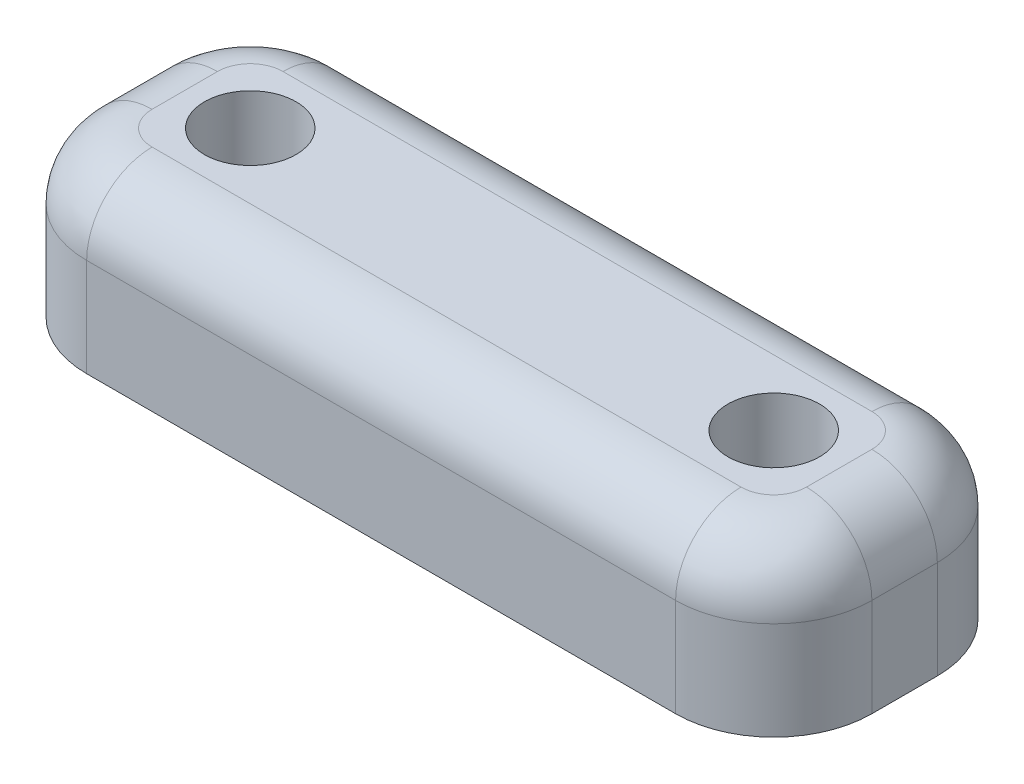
ISO-10303-21;
HEADER;
FILE_DESCRIPTION(('STEP AP214'),'2;1');
FILE_NAME('part.step','',(''),(''),'','','');
FILE_SCHEMA(('AUTOMOTIVE_DESIGN { 1 0 10303 214 1 1 1 1 }'));
ENDSEC;
DATA;
#1=APPLICATION_CONTEXT('core data for automotive mechanical design processes');
#2=APPLICATION_PROTOCOL_DEFINITION('international standard','automotive_design',2000,#1);
#3=PRODUCT_CONTEXT('',#1,'mechanical');
#4=PRODUCT('Part','Part','',(#3));
#5=PRODUCT_RELATED_PRODUCT_CATEGORY('part','',(#4));
#6=PRODUCT_DEFINITION_FORMATION('','',#4);
#7=PRODUCT_DEFINITION_CONTEXT('part definition',#1,'design');
#8=PRODUCT_DEFINITION('design','',#6,#7);
#9=PRODUCT_DEFINITION_SHAPE('','',#8);
#10=(LENGTH_UNIT() NAMED_UNIT(*) SI_UNIT(.MILLI.,.METRE.));
#11=(NAMED_UNIT(*) PLANE_ANGLE_UNIT() SI_UNIT($,.RADIAN.));
#12=(NAMED_UNIT(*) SI_UNIT($,.STERADIAN.) SOLID_ANGLE_UNIT());
#13=UNCERTAINTY_MEASURE_WITH_UNIT(LENGTH_MEASURE(1.E-05),#10,'distance_accuracy_value','');
#14=(GEOMETRIC_REPRESENTATION_CONTEXT(3) GLOBAL_UNCERTAINTY_ASSIGNED_CONTEXT((#13)) GLOBAL_UNIT_ASSIGNED_CONTEXT((#10,
#11,#12)) REPRESENTATION_CONTEXT('',''));
#15=CARTESIAN_POINT('',(0.,0.,0.));
#16=DIRECTION('',(0.,0.,1.));
#17=DIRECTION('',(1.,0.,0.));
#18=AXIS2_PLACEMENT_3D('',#15,#16,#17);
#19=CARTESIAN_POINT('',(0.,5.,0.));
#20=DIRECTION('',(0.,1.,0.));
#21=DIRECTION('',(0.,0.,1.));
#22=AXIS2_PLACEMENT_3D('',#19,#20,#21);
#23=PLANE('',#22);
#24=CARTESIAN_POINT('',(-9.,5.,0.752347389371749));
#25=DIRECTION('',(0.,1.,0.));
#26=DIRECTION('',(0.,0.,1.));
#27=AXIS2_PLACEMENT_3D('',#24,#25,#26);
#28=CIRCLE('',#27,1.);
#29=CARTESIAN_POINT('',(-9.,5.,-0.247652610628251));
#30=VERTEX_POINT('',#29);
#31=CARTESIAN_POINT('',(-10.,5.,0.75234738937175));
#32=VERTEX_POINT('',#31);
#33=EDGE_CURVE('E192',#30,#32,#28,.T.);
#34=ORIENTED_EDGE('',*,*,#33,.T.);
#35=DIRECTION('',(0.,0.,1.));
#36=VECTOR('',#35,1.);
#37=CARTESIAN_POINT('',(-10.,5.,2.75234738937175));
#38=LINE('',#37,#36);
#39=CARTESIAN_POINT('',(-10.,5.,2.75234738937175));
#40=VERTEX_POINT('',#39);
#41=EDGE_CURVE('E194',#32,#40,#38,.T.);
#42=ORIENTED_EDGE('',*,*,#41,.T.);
#43=CARTESIAN_POINT('',(-9.,5.,2.75234738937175));
#44=DIRECTION('',(0.,1.,0.));
#45=DIRECTION('',(0.,0.,1.));
#46=AXIS2_PLACEMENT_3D('',#43,#44,#45);
#47=CIRCLE('',#46,1.);
#48=CARTESIAN_POINT('',(-9.,5.,3.75234738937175));
#49=VERTEX_POINT('',#48);
#50=EDGE_CURVE('E181',#40,#49,#47,.T.);
#51=ORIENTED_EDGE('',*,*,#50,.T.);
#52=DIRECTION('',(1.,0.,0.));
#53=VECTOR('',#52,1.);
#54=CARTESIAN_POINT('',(9.,5.,3.75234738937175));
#55=LINE('',#54,#53);
#56=CARTESIAN_POINT('',(9.,5.,3.75234738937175));
#57=VERTEX_POINT('',#56);
#58=EDGE_CURVE('E179',#49,#57,#55,.T.);
#59=ORIENTED_EDGE('',*,*,#58,.T.);
#60=CARTESIAN_POINT('',(9.,5.,2.75234738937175));
#61=DIRECTION('',(0.,1.,0.));
#62=DIRECTION('',(0.,0.,1.));
#63=AXIS2_PLACEMENT_3D('',#60,#61,#62);
#64=CIRCLE('',#63,1.);
#65=CARTESIAN_POINT('',(10.,5.,2.75234738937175));
#66=VERTEX_POINT('',#65);
#67=EDGE_CURVE('E183',#57,#66,#64,.T.);
#68=ORIENTED_EDGE('',*,*,#67,.T.);
#69=DIRECTION('',(0.,0.,-1.));
#70=VECTOR('',#69,1.);
#71=CARTESIAN_POINT('',(10.,5.,0.752347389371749));
#72=LINE('',#71,#70);
#73=CARTESIAN_POINT('',(10.,5.,0.752347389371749));
#74=VERTEX_POINT('',#73);
#75=EDGE_CURVE('E185',#66,#74,#72,.T.);
#76=ORIENTED_EDGE('',*,*,#75,.T.);
#77=CARTESIAN_POINT('',(9.,5.,0.752347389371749));
#78=DIRECTION('',(0.,1.,0.));
#79=DIRECTION('',(0.,0.,1.));
#80=AXIS2_PLACEMENT_3D('',#77,#78,#79);
#81=CIRCLE('',#80,1.);
#82=CARTESIAN_POINT('',(9.,5.,-0.247652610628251));
#83=VERTEX_POINT('',#82);
#84=EDGE_CURVE('E187',#74,#83,#81,.T.);
#85=ORIENTED_EDGE('',*,*,#84,.T.);
#86=DIRECTION('',(-1.,0.,0.));
#87=VECTOR('',#86,1.);
#88=CARTESIAN_POINT('',(-9.,5.,-0.247652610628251));
#89=LINE('',#88,#87);
#90=EDGE_CURVE('E190',#83,#30,#89,.T.);
#91=ORIENTED_EDGE('',*,*,#90,.T.);
#92=EDGE_LOOP('',(#34,#42,#51,#59,#68,#76,#85,#91));
#93=FACE_BOUND('',#92,.T.);
#94=CARTESIAN_POINT('',(-8.,5.,1.75234738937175));
#95=DIRECTION('',(0.,1.,0.));
#96=DIRECTION('',(0.,0.,1.));
#97=AXIS2_PLACEMENT_3D('',#94,#95,#96);
#98=CIRCLE('',#97,1.4);
#99=CARTESIAN_POINT('',(-8.,5.,3.15234738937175));
#100=VERTEX_POINT('',#99);
#101=EDGE_CURVE('E242',#100,#100,#98,.T.);
#102=ORIENTED_EDGE('',*,*,#101,.F.);
#103=EDGE_LOOP('',(#102));
#104=FACE_BOUND('',#103,.T.);
#105=CARTESIAN_POINT('',(8.,5.,1.75234738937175));
#106=DIRECTION('',(0.,1.,0.));
#107=DIRECTION('',(0.,0.,1.));
#108=AXIS2_PLACEMENT_3D('',#105,#106,#107);
#109=CIRCLE('',#108,1.4);
#110=CARTESIAN_POINT('',(8.,5.,3.15234738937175));
#111=VERTEX_POINT('',#110);
#112=EDGE_CURVE('E234',#111,#111,#109,.T.);
#113=ORIENTED_EDGE('',*,*,#112,.F.);
#114=EDGE_LOOP('',(#113));
#115=FACE_BOUND('',#114,.T.);
#116=ADVANCED_FACE('F34',(#93,#104,#115),#23,.T.);
#117=CARTESIAN_POINT('',(0.,0.,0.));
#118=DIRECTION('',(0.,1.,0.));
#119=DIRECTION('',(0.,0.,1.));
#120=AXIS2_PLACEMENT_3D('',#117,#118,#119);
#121=PLANE('',#120);
#122=DIRECTION('',(0.,0.,-1.));
#123=VECTOR('',#122,1.);
#124=CARTESIAN_POINT('',(12.,0.,-2.24765261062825));
#125=LINE('',#124,#123);
#126=CARTESIAN_POINT('',(12.,0.,2.75234738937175));
#127=VERTEX_POINT('',#126);
#128=CARTESIAN_POINT('',(12.,0.,0.752347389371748));
#129=VERTEX_POINT('',#128);
#130=EDGE_CURVE('E131',#127,#129,#125,.T.);
#131=ORIENTED_EDGE('',*,*,#130,.F.);
#132=CARTESIAN_POINT('',(9.,0.,2.75234738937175));
#133=DIRECTION('',(0.,1.,0.));
#134=DIRECTION('',(0.,0.,1.));
#135=AXIS2_PLACEMENT_3D('',#132,#133,#134);
#136=CIRCLE('',#135,3.);
#137=CARTESIAN_POINT('',(9.,0.,5.75234738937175));
#138=VERTEX_POINT('',#137);
#139=EDGE_CURVE('E141',#127,#138,#136,.F.);
#140=ORIENTED_EDGE('',*,*,#139,.T.);
#141=DIRECTION('',(1.,0.,0.));
#142=VECTOR('',#141,1.);
#143=CARTESIAN_POINT('',(-12.,0.,5.75234738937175));
#144=LINE('',#143,#142);
#145=CARTESIAN_POINT('',(-9.,0.,5.75234738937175));
#146=VERTEX_POINT('',#145);
#147=EDGE_CURVE('E156',#146,#138,#144,.T.);
#148=ORIENTED_EDGE('',*,*,#147,.F.);
#149=CARTESIAN_POINT('',(-9.,0.,2.75234738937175));
#150=DIRECTION('',(0.,1.,0.));
#151=DIRECTION('',(0.,0.,1.));
#152=AXIS2_PLACEMENT_3D('',#149,#150,#151);
#153=CIRCLE('',#152,3.);
#154=CARTESIAN_POINT('',(-12.,0.,2.75234738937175));
#155=VERTEX_POINT('',#154);
#156=EDGE_CURVE('E166',#146,#155,#153,.F.);
#157=ORIENTED_EDGE('',*,*,#156,.T.);
#158=DIRECTION('',(0.,0.,1.));
#159=VECTOR('',#158,1.);
#160=CARTESIAN_POINT('',(-12.,0.,-2.24765261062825));
#161=LINE('',#160,#159);
#162=CARTESIAN_POINT('',(-12.,0.,0.75234738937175));
#163=VERTEX_POINT('',#162);
#164=EDGE_CURVE('E160',#163,#155,#161,.T.);
#165=ORIENTED_EDGE('',*,*,#164,.F.);
#166=CARTESIAN_POINT('',(-9.,0.,0.752347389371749));
#167=DIRECTION('',(0.,1.,0.));
#168=DIRECTION('',(0.,0.,1.));
#169=AXIS2_PLACEMENT_3D('',#166,#167,#168);
#170=CIRCLE('',#169,3.);
#171=CARTESIAN_POINT('',(-9.,0.,-2.24765261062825));
#172=VERTEX_POINT('',#171);
#173=EDGE_CURVE('E137',#163,#172,#170,.F.);
#174=ORIENTED_EDGE('',*,*,#173,.T.);
#175=DIRECTION('',(-1.,0.,0.));
#176=VECTOR('',#175,1.);
#177=CARTESIAN_POINT('',(-12.,0.,-2.24765261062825));
#178=LINE('',#177,#176);
#179=CARTESIAN_POINT('',(9.,0.,-2.24765261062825));
#180=VERTEX_POINT('',#179);
#181=EDGE_CURVE('E155',#180,#172,#178,.T.);
#182=ORIENTED_EDGE('',*,*,#181,.F.);
#183=CARTESIAN_POINT('',(9.,0.,0.752347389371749));
#184=DIRECTION('',(0.,1.,0.));
#185=DIRECTION('',(0.,0.,1.));
#186=AXIS2_PLACEMENT_3D('',#183,#184,#185);
#187=CIRCLE('',#186,3.);
#188=EDGE_CURVE('E149',#180,#129,#187,.F.);
#189=ORIENTED_EDGE('',*,*,#188,.T.);
#190=EDGE_LOOP('',(#131,#140,#148,#157,#165,#174,#182,#189));
#191=FACE_BOUND('',#190,.T.);
#192=CARTESIAN_POINT('',(-8.,0.,1.75234738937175));
#193=DIRECTION('',(0.,1.,0.));
#194=DIRECTION('',(0.,0.,1.));
#195=AXIS2_PLACEMENT_3D('',#192,#193,#194);
#196=CIRCLE('',#195,1.4);
#197=CARTESIAN_POINT('',(-8.,0.,3.15234738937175));
#198=VERTEX_POINT('',#197);
#199=EDGE_CURVE('E239',#198,#198,#196,.T.);
#200=ORIENTED_EDGE('',*,*,#199,.T.);
#201=EDGE_LOOP('',(#200));
#202=FACE_BOUND('',#201,.T.);
#203=CARTESIAN_POINT('',(8.,0.,1.75234738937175));
#204=DIRECTION('',(0.,1.,0.));
#205=DIRECTION('',(0.,0.,1.));
#206=AXIS2_PLACEMENT_3D('',#203,#204,#205);
#207=CIRCLE('',#206,1.4);
#208=CARTESIAN_POINT('',(8.,0.,3.15234738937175));
#209=VERTEX_POINT('',#208);
#210=EDGE_CURVE('E228',#209,#209,#207,.T.);
#211=ORIENTED_EDGE('',*,*,#210,.T.);
#212=EDGE_LOOP('',(#211));
#213=FACE_BOUND('',#212,.T.);
#214=ADVANCED_FACE('F151',(#191,#202,#213),#121,.F.);
#215=CARTESIAN_POINT('',(-12.,5.,-2.24765261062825));
#216=DIRECTION('',(1.,0.,0.));
#217=DIRECTION('',(0.,0.,-1.));
#218=AXIS2_PLACEMENT_3D('',#215,#216,#217);
#219=PLANE('',#218);
#220=DIRECTION('',(0.,-1.,0.));
#221=VECTOR('',#220,1.);
#222=CARTESIAN_POINT('',(-12.,5.,2.75234738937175));
#223=LINE('',#222,#221);
#224=CARTESIAN_POINT('',(-12.,3.,2.75234738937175));
#225=VERTEX_POINT('',#224);
#226=EDGE_CURVE('E177',#155,#225,#223,.F.);
#227=ORIENTED_EDGE('',*,*,#226,.T.);
#228=DIRECTION('',(0.,0.,1.));
#229=VECTOR('',#228,1.);
#230=CARTESIAN_POINT('',(-12.,3.,0.75234738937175));
#231=LINE('',#230,#229);
#232=CARTESIAN_POINT('',(-12.,3.,0.75234738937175));
#233=VERTEX_POINT('',#232);
#234=EDGE_CURVE('E59',#225,#233,#231,.F.);
#235=ORIENTED_EDGE('',*,*,#234,.T.);
#236=DIRECTION('',(0.,-1.,0.));
#237=VECTOR('',#236,1.);
#238=CARTESIAN_POINT('',(-12.,5.,0.75234738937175));
#239=LINE('',#238,#237);
#240=EDGE_CURVE('E175',#233,#163,#239,.T.);
#241=ORIENTED_EDGE('',*,*,#240,.T.);
#242=ORIENTED_EDGE('',*,*,#164,.T.);
#243=EDGE_LOOP('',(#227,#235,#241,#242));
#244=FACE_BOUND('',#243,.T.);
#245=ADVANCED_FACE('F249',(#244),#219,.F.);
#246=CARTESIAN_POINT('',(-12.,5.,5.75234738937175));
#247=DIRECTION('',(0.,0.,-1.));
#248=DIRECTION('',(-1.,0.,0.));
#249=AXIS2_PLACEMENT_3D('',#246,#247,#248);
#250=PLANE('',#249);
#251=DIRECTION('',(0.,-1.,0.));
#252=VECTOR('',#251,1.);
#253=CARTESIAN_POINT('',(9.,5.,5.75234738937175));
#254=LINE('',#253,#252);
#255=CARTESIAN_POINT('',(9.,3.,5.75234738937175));
#256=VERTEX_POINT('',#255);
#257=EDGE_CURVE('E144',#138,#256,#254,.F.);
#258=ORIENTED_EDGE('',*,*,#257,.T.);
#259=DIRECTION('',(1.,0.,0.));
#260=VECTOR('',#259,1.);
#261=CARTESIAN_POINT('',(-9.,3.,5.75234738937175));
#262=LINE('',#261,#260);
#263=CARTESIAN_POINT('',(-9.,3.,5.75234738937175));
#264=VERTEX_POINT('',#263);
#265=EDGE_CURVE('E11',#256,#264,#262,.F.);
#266=ORIENTED_EDGE('',*,*,#265,.T.);
#267=DIRECTION('',(0.,-1.,0.));
#268=VECTOR('',#267,1.);
#269=CARTESIAN_POINT('',(-9.,5.,5.75234738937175));
#270=LINE('',#269,#268);
#271=EDGE_CURVE('E148',#264,#146,#270,.T.);
#272=ORIENTED_EDGE('',*,*,#271,.T.);
#273=ORIENTED_EDGE('',*,*,#147,.T.);
#274=EDGE_LOOP('',(#258,#266,#272,#273));
#275=FACE_BOUND('',#274,.T.);
#276=ADVANCED_FACE('F288',(#275),#250,.F.);
#277=CARTESIAN_POINT('',(12.,5.,-2.24765261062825));
#278=DIRECTION('',(-1.,0.,0.));
#279=DIRECTION('',(0.,0.,1.));
#280=AXIS2_PLACEMENT_3D('',#277,#278,#279);
#281=PLANE('',#280);
#282=DIRECTION('',(0.,-1.,0.));
#283=VECTOR('',#282,1.);
#284=CARTESIAN_POINT('',(12.,5.,0.752347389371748));
#285=LINE('',#284,#283);
#286=CARTESIAN_POINT('',(12.,3.,0.752347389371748));
#287=VERTEX_POINT('',#286);
#288=EDGE_CURVE('E138',#129,#287,#285,.F.);
#289=ORIENTED_EDGE('',*,*,#288,.T.);
#290=DIRECTION('',(0.,0.,-1.));
#291=VECTOR('',#290,1.);
#292=CARTESIAN_POINT('',(12.,3.,2.75234738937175));
#293=LINE('',#292,#291);
#294=CARTESIAN_POINT('',(12.,3.,2.75234738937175));
#295=VERTEX_POINT('',#294);
#296=EDGE_CURVE('E134',#287,#295,#293,.F.);
#297=ORIENTED_EDGE('',*,*,#296,.T.);
#298=DIRECTION('',(0.,-1.,0.));
#299=VECTOR('',#298,1.);
#300=CARTESIAN_POINT('',(12.,5.,2.75234738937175));
#301=LINE('',#300,#299);
#302=EDGE_CURVE('E126',#295,#127,#301,.T.);
#303=ORIENTED_EDGE('',*,*,#302,.T.);
#304=ORIENTED_EDGE('',*,*,#130,.T.);
#305=EDGE_LOOP('',(#289,#297,#303,#304));
#306=FACE_BOUND('',#305,.T.);
#307=ADVANCED_FACE('F129',(#306),#281,.F.);
#308=CARTESIAN_POINT('',(-12.,5.,-2.24765261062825));
#309=DIRECTION('',(0.,0.,1.));
#310=DIRECTION('',(1.,0.,0.));
#311=AXIS2_PLACEMENT_3D('',#308,#309,#310);
#312=PLANE('',#311);
#313=DIRECTION('',(0.,-1.,0.));
#314=VECTOR('',#313,1.);
#315=CARTESIAN_POINT('',(-9.,5.,-2.24765261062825));
#316=LINE('',#315,#314);
#317=CARTESIAN_POINT('',(-9.,3.,-2.24765261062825));
#318=VERTEX_POINT('',#317);
#319=EDGE_CURVE('E171',#172,#318,#316,.F.);
#320=ORIENTED_EDGE('',*,*,#319,.T.);
#321=DIRECTION('',(-1.,0.,0.));
#322=VECTOR('',#321,1.);
#323=CARTESIAN_POINT('',(9.,3.,-2.24765261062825));
#324=LINE('',#323,#322);
#325=CARTESIAN_POINT('',(9.,3.,-2.24765261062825));
#326=VERTEX_POINT('',#325);
#327=EDGE_CURVE('E43',#318,#326,#324,.F.);
#328=ORIENTED_EDGE('',*,*,#327,.T.);
#329=DIRECTION('',(0.,-1.,0.));
#330=VECTOR('',#329,1.);
#331=CARTESIAN_POINT('',(9.,5.,-2.24765261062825));
#332=LINE('',#331,#330);
#333=EDGE_CURVE('E173',#326,#180,#332,.T.);
#334=ORIENTED_EDGE('',*,*,#333,.T.);
#335=ORIENTED_EDGE('',*,*,#181,.T.);
#336=EDGE_LOOP('',(#320,#328,#334,#335));
#337=FACE_BOUND('',#336,.T.);
#338=ADVANCED_FACE('F271',(#337),#312,.F.);
#339=CARTESIAN_POINT('',(-8.,5.,1.75234738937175));
#340=DIRECTION('',(0.,-1.,0.));
#341=DIRECTION('',(0.,0.,-1.));
#342=AXIS2_PLACEMENT_3D('',#339,#340,#341);
#343=CYLINDRICAL_SURFACE('',#342,1.4);
#344=ORIENTED_EDGE('',*,*,#101,.T.);
#345=EDGE_LOOP('',(#344));
#346=FACE_BOUND('',#345,.T.);
#347=ORIENTED_EDGE('',*,*,#199,.F.);
#348=EDGE_LOOP('',(#347));
#349=FACE_BOUND('',#348,.T.);
#350=ADVANCED_FACE('F301',(#346,#349),#343,.F.);
#351=CARTESIAN_POINT('',(8.,5.,1.75234738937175));
#352=DIRECTION('',(0.,-1.,0.));
#353=DIRECTION('',(0.,0.,-1.));
#354=AXIS2_PLACEMENT_3D('',#351,#352,#353);
#355=CYLINDRICAL_SURFACE('',#354,1.4);
#356=ORIENTED_EDGE('',*,*,#112,.T.);
#357=EDGE_LOOP('',(#356));
#358=FACE_BOUND('',#357,.T.);
#359=ORIENTED_EDGE('',*,*,#210,.F.);
#360=EDGE_LOOP('',(#359));
#361=FACE_BOUND('',#360,.T.);
#362=ADVANCED_FACE('F298',(#358,#361),#355,.F.);
#363=CARTESIAN_POINT('',(9.,5.,2.75234738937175));
#364=DIRECTION('',(0.,-1.,0.));
#365=DIRECTION('',(0.,0.,-1.));
#366=AXIS2_PLACEMENT_3D('',#363,#364,#365);
#367=CYLINDRICAL_SURFACE('',#366,3.);
#368=ORIENTED_EDGE('',*,*,#302,.F.);
#369=CARTESIAN_POINT('',(9.,3.,2.75234738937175));
#370=DIRECTION('',(0.,1.,0.));
#371=DIRECTION('',(0.,0.,1.));
#372=AXIS2_PLACEMENT_3D('',#369,#370,#371);
#373=CIRCLE('',#372,3.);
#374=EDGE_CURVE('E200',#295,#256,#373,.F.);
#375=ORIENTED_EDGE('',*,*,#374,.T.);
#376=ORIENTED_EDGE('',*,*,#257,.F.);
#377=ORIENTED_EDGE('',*,*,#139,.F.);
#378=EDGE_LOOP('',(#368,#375,#376,#377));
#379=FACE_BOUND('',#378,.T.);
#380=ADVANCED_FACE('F142',(#379),#367,.T.);
#381=CARTESIAN_POINT('',(9.,5.,0.752347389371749));
#382=DIRECTION('',(0.,-1.,0.));
#383=DIRECTION('',(0.,0.,-1.));
#384=AXIS2_PLACEMENT_3D('',#381,#382,#383);
#385=CYLINDRICAL_SURFACE('',#384,3.);
#386=ORIENTED_EDGE('',*,*,#333,.F.);
#387=CARTESIAN_POINT('',(9.,3.,0.752347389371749));
#388=DIRECTION('',(0.,1.,0.));
#389=DIRECTION('',(0.,0.,1.));
#390=AXIS2_PLACEMENT_3D('',#387,#388,#389);
#391=CIRCLE('',#390,3.);
#392=EDGE_CURVE('E196',#326,#287,#391,.F.);
#393=ORIENTED_EDGE('',*,*,#392,.T.);
#394=ORIENTED_EDGE('',*,*,#288,.F.);
#395=ORIENTED_EDGE('',*,*,#188,.F.);
#396=EDGE_LOOP('',(#386,#393,#394,#395));
#397=FACE_BOUND('',#396,.T.);
#398=ADVANCED_FACE('F274',(#397),#385,.T.);
#399=CARTESIAN_POINT('',(-9.,5.,2.75234738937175));
#400=DIRECTION('',(0.,-1.,0.));
#401=DIRECTION('',(0.,0.,-1.));
#402=AXIS2_PLACEMENT_3D('',#399,#400,#401);
#403=CYLINDRICAL_SURFACE('',#402,3.);
#404=ORIENTED_EDGE('',*,*,#271,.F.);
#405=CARTESIAN_POINT('',(-9.,3.,2.75234738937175));
#406=DIRECTION('',(0.,1.,0.));
#407=DIRECTION('',(0.,0.,1.));
#408=AXIS2_PLACEMENT_3D('',#405,#406,#407);
#409=CIRCLE('',#408,3.);
#410=EDGE_CURVE('E202',#264,#225,#409,.F.);
#411=ORIENTED_EDGE('',*,*,#410,.T.);
#412=ORIENTED_EDGE('',*,*,#226,.F.);
#413=ORIENTED_EDGE('',*,*,#156,.F.);
#414=EDGE_LOOP('',(#404,#411,#412,#413));
#415=FACE_BOUND('',#414,.T.);
#416=ADVANCED_FACE('F254',(#415),#403,.T.);
#417=CARTESIAN_POINT('',(-9.,5.,0.752347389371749));
#418=DIRECTION('',(0.,-1.,0.));
#419=DIRECTION('',(0.,0.,-1.));
#420=AXIS2_PLACEMENT_3D('',#417,#418,#419);
#421=CYLINDRICAL_SURFACE('',#420,3.);
#422=ORIENTED_EDGE('',*,*,#240,.F.);
#423=CARTESIAN_POINT('',(-9.,3.,0.752347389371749));
#424=DIRECTION('',(0.,1.,0.));
#425=DIRECTION('',(0.,0.,1.));
#426=AXIS2_PLACEMENT_3D('',#423,#424,#425);
#427=CIRCLE('',#426,3.);
#428=EDGE_CURVE('E51',#233,#318,#427,.F.);
#429=ORIENTED_EDGE('',*,*,#428,.T.);
#430=ORIENTED_EDGE('',*,*,#319,.F.);
#431=ORIENTED_EDGE('',*,*,#173,.F.);
#432=EDGE_LOOP('',(#422,#429,#430,#431));
#433=FACE_BOUND('',#432,.T.);
#434=ADVANCED_FACE('F325',(#433),#421,.T.);
#435=CARTESIAN_POINT('',(-9.,3.,2.75234738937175));
#436=DIRECTION('',(0.,1.,0.));
#437=DIRECTION('',(0.,0.,1.));
#438=AXIS2_PLACEMENT_3D('',#435,#436,#437);
#439=DEGENERATE_TOROIDAL_SURFACE('',#438,1.,2.,.T.);
#440=CARTESIAN_POINT('',(-10.,3.,2.75234738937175));
#441=DIRECTION('',(0.,0.,-1.));
#442=DIRECTION('',(-1.,0.,0.));
#443=AXIS2_PLACEMENT_3D('',#440,#441,#442);
#444=CIRCLE('',#443,2.);
#445=EDGE_CURVE('E222',#225,#40,#444,.T.);
#446=ORIENTED_EDGE('',*,*,#445,.F.);
#447=ORIENTED_EDGE('',*,*,#410,.F.);
#448=CARTESIAN_POINT('',(-9.,3.,3.75234738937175));
#449=DIRECTION('',(1.,0.,0.));
#450=DIRECTION('',(0.,0.,-1.));
#451=AXIS2_PLACEMENT_3D('',#448,#449,#450);
#452=CIRCLE('',#451,2.);
#453=EDGE_CURVE('E38',#49,#264,#452,.T.);
#454=ORIENTED_EDGE('',*,*,#453,.F.);
#455=ORIENTED_EDGE('',*,*,#50,.F.);
#456=EDGE_LOOP('',(#446,#447,#454,#455));
#457=FACE_BOUND('',#456,.T.);
#458=ADVANCED_FACE('F36',(#457),#439,.T.);
#459=CARTESIAN_POINT('',(0.,3.,3.75234738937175));
#460=DIRECTION('',(-1.,0.,0.));
#461=DIRECTION('',(0.,0.,1.));
#462=AXIS2_PLACEMENT_3D('',#459,#460,#461);
#463=CYLINDRICAL_SURFACE('',#462,2.);
#464=ORIENTED_EDGE('',*,*,#453,.T.);
#465=ORIENTED_EDGE('',*,*,#265,.F.);
#466=CARTESIAN_POINT('',(9.,3.,3.75234738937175));
#467=DIRECTION('',(1.,0.,0.));
#468=DIRECTION('',(0.,0.,-1.));
#469=AXIS2_PLACEMENT_3D('',#466,#467,#468);
#470=CIRCLE('',#469,2.);
#471=EDGE_CURVE('E220',#57,#256,#470,.T.);
#472=ORIENTED_EDGE('',*,*,#471,.F.);
#473=ORIENTED_EDGE('',*,*,#58,.F.);
#474=EDGE_LOOP('',(#464,#465,#472,#473));
#475=FACE_BOUND('',#474,.T.);
#476=ADVANCED_FACE('F289',(#475),#463,.T.);
#477=CARTESIAN_POINT('',(-10.,3.,0.));
#478=DIRECTION('',(0.,0.,-1.));
#479=DIRECTION('',(-1.,0.,0.));
#480=AXIS2_PLACEMENT_3D('',#477,#478,#479);
#481=CYLINDRICAL_SURFACE('',#480,2.);
#482=ORIENTED_EDGE('',*,*,#445,.T.);
#483=ORIENTED_EDGE('',*,*,#41,.F.);
#484=CARTESIAN_POINT('',(-10.,3.,0.75234738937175));
#485=DIRECTION('',(0.,0.,-1.));
#486=DIRECTION('',(-1.,0.,0.));
#487=AXIS2_PLACEMENT_3D('',#484,#485,#486);
#488=CIRCLE('',#487,2.);
#489=EDGE_CURVE('E217',#233,#32,#488,.T.);
#490=ORIENTED_EDGE('',*,*,#489,.F.);
#491=ORIENTED_EDGE('',*,*,#234,.F.);
#492=EDGE_LOOP('',(#482,#483,#490,#491));
#493=FACE_BOUND('',#492,.T.);
#494=ADVANCED_FACE('F259',(#493),#481,.T.);
#495=CARTESIAN_POINT('',(9.,3.,2.75234738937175));
#496=DIRECTION('',(0.,1.,0.));
#497=DIRECTION('',(0.,0.,1.));
#498=AXIS2_PLACEMENT_3D('',#495,#496,#497);
#499=DEGENERATE_TOROIDAL_SURFACE('',#498,1.,2.,.T.);
#500=ORIENTED_EDGE('',*,*,#471,.T.);
#501=ORIENTED_EDGE('',*,*,#374,.F.);
#502=CARTESIAN_POINT('',(10.,3.,2.75234738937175));
#503=DIRECTION('',(0.,0.,-1.));
#504=DIRECTION('',(-1.,0.,0.));
#505=AXIS2_PLACEMENT_3D('',#502,#503,#504);
#506=CIRCLE('',#505,2.);
#507=EDGE_CURVE('E214',#66,#295,#506,.T.);
#508=ORIENTED_EDGE('',*,*,#507,.F.);
#509=ORIENTED_EDGE('',*,*,#67,.F.);
#510=EDGE_LOOP('',(#500,#501,#508,#509));
#511=FACE_BOUND('',#510,.T.);
#512=ADVANCED_FACE('F285',(#511),#499,.T.);
#513=CARTESIAN_POINT('',(-9.,3.,0.752347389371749));
#514=DIRECTION('',(0.,1.,0.));
#515=DIRECTION('',(0.,0.,1.));
#516=AXIS2_PLACEMENT_3D('',#513,#514,#515);
#517=DEGENERATE_TOROIDAL_SURFACE('',#516,1.,2.,.T.);
#518=ORIENTED_EDGE('',*,*,#489,.T.);
#519=ORIENTED_EDGE('',*,*,#33,.F.);
#520=CARTESIAN_POINT('',(-9.,3.,-0.247652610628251));
#521=DIRECTION('',(1.,0.,0.));
#522=DIRECTION('',(0.,0.,-1.));
#523=AXIS2_PLACEMENT_3D('',#520,#521,#522);
#524=CIRCLE('',#523,2.);
#525=EDGE_CURVE('E211',#318,#30,#524,.T.);
#526=ORIENTED_EDGE('',*,*,#525,.F.);
#527=ORIENTED_EDGE('',*,*,#428,.F.);
#528=EDGE_LOOP('',(#518,#519,#526,#527));
#529=FACE_BOUND('',#528,.T.);
#530=ADVANCED_FACE('F263',(#529),#517,.T.);
#531=CARTESIAN_POINT('',(10.,3.,0.));
#532=DIRECTION('',(0.,0.,1.));
#533=DIRECTION('',(1.,0.,0.));
#534=AXIS2_PLACEMENT_3D('',#531,#532,#533);
#535=CYLINDRICAL_SURFACE('',#534,2.);
#536=ORIENTED_EDGE('',*,*,#507,.T.);
#537=ORIENTED_EDGE('',*,*,#296,.F.);
#538=CARTESIAN_POINT('',(10.,3.,0.752347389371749));
#539=DIRECTION('',(0.,0.,-1.));
#540=DIRECTION('',(-1.,0.,0.));
#541=AXIS2_PLACEMENT_3D('',#538,#539,#540);
#542=CIRCLE('',#541,2.);
#543=EDGE_CURVE('E209',#74,#287,#542,.T.);
#544=ORIENTED_EDGE('',*,*,#543,.F.);
#545=ORIENTED_EDGE('',*,*,#75,.F.);
#546=EDGE_LOOP('',(#536,#537,#544,#545));
#547=FACE_BOUND('',#546,.T.);
#548=ADVANCED_FACE('F281',(#547),#535,.T.);
#549=CARTESIAN_POINT('',(0.,3.,-0.247652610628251));
#550=DIRECTION('',(1.,0.,0.));
#551=DIRECTION('',(0.,0.,-1.));
#552=AXIS2_PLACEMENT_3D('',#549,#550,#551);
#553=CYLINDRICAL_SURFACE('',#552,2.);
#554=ORIENTED_EDGE('',*,*,#525,.T.);
#555=ORIENTED_EDGE('',*,*,#90,.F.);
#556=CARTESIAN_POINT('',(9.,3.,-0.247652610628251));
#557=DIRECTION('',(1.,0.,0.));
#558=DIRECTION('',(0.,0.,-1.));
#559=AXIS2_PLACEMENT_3D('',#556,#557,#558);
#560=CIRCLE('',#559,2.);
#561=EDGE_CURVE('E207',#326,#83,#560,.T.);
#562=ORIENTED_EDGE('',*,*,#561,.F.);
#563=ORIENTED_EDGE('',*,*,#327,.F.);
#564=EDGE_LOOP('',(#554,#555,#562,#563));
#565=FACE_BOUND('',#564,.T.);
#566=ADVANCED_FACE('F268',(#565),#553,.T.);
#567=CARTESIAN_POINT('',(9.,3.,0.752347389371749));
#568=DIRECTION('',(0.,1.,0.));
#569=DIRECTION('',(0.,0.,1.));
#570=AXIS2_PLACEMENT_3D('',#567,#568,#569);
#571=DEGENERATE_TOROIDAL_SURFACE('',#570,1.,2.,.T.);
#572=ORIENTED_EDGE('',*,*,#543,.T.);
#573=ORIENTED_EDGE('',*,*,#392,.F.);
#574=ORIENTED_EDGE('',*,*,#561,.T.);
#575=ORIENTED_EDGE('',*,*,#84,.F.);
#576=EDGE_LOOP('',(#572,#573,#574,#575));
#577=FACE_BOUND('',#576,.T.);
#578=ADVANCED_FACE('F276',(#577),#571,.T.);
#579=CLOSED_SHELL('',(#116,#214,#245,#276,#307,#338,#350,#362,#380,#398,#416,#434,#458,#476,
#494,#512,#530,#548,#566,#578));
#580=MANIFOLD_SOLID_BREP('B2',#579);
#581=ADVANCED_BREP_SHAPE_REPRESENTATION('',(#18,#580),#14);
#582=SHAPE_DEFINITION_REPRESENTATION(#9,#581);
ENDSEC;
END-ISO-10303-21;
